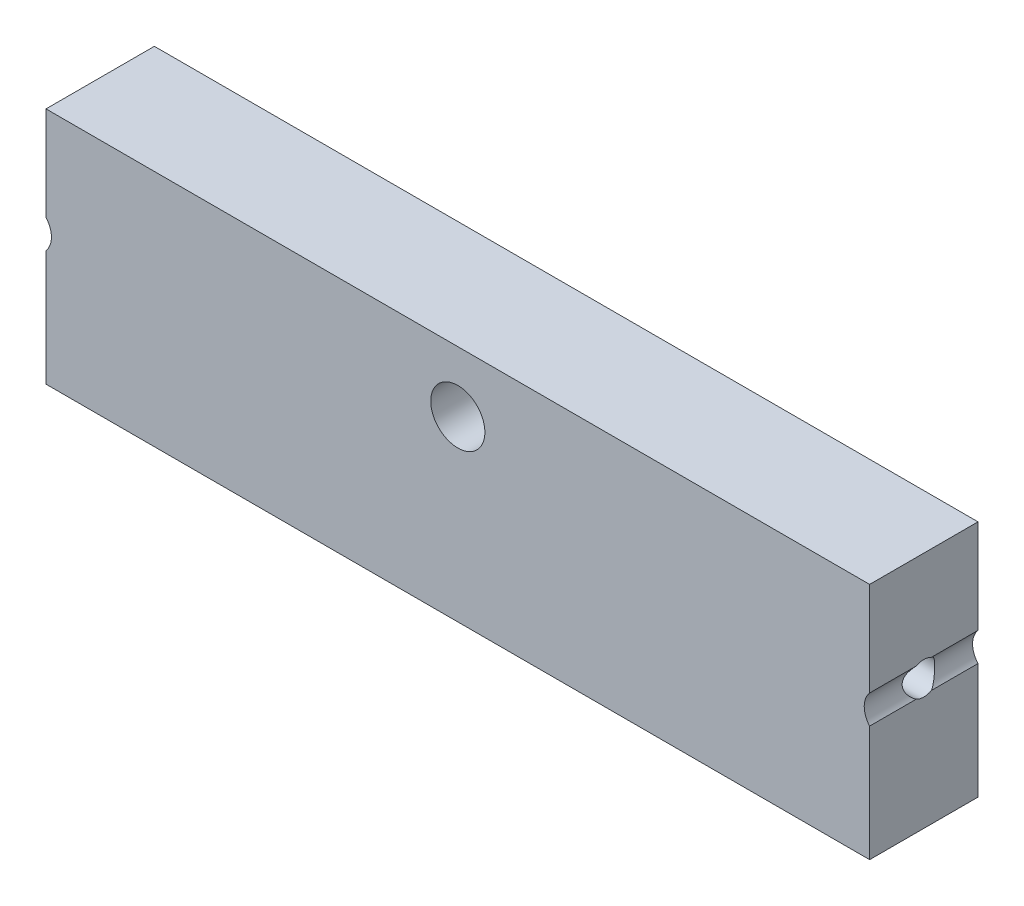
ISO-10303-21;
HEADER;
FILE_DESCRIPTION(('STEP AP214'),'2;1');
FILE_NAME('part.step','',(''),(''),'','','');
FILE_SCHEMA(('AUTOMOTIVE_DESIGN { 1 0 10303 214 1 1 1 1 }'));
ENDSEC;
DATA;
#1=APPLICATION_CONTEXT('core data for automotive mechanical design processes');
#2=APPLICATION_PROTOCOL_DEFINITION('international standard','automotive_design',2000,#1);
#3=PRODUCT_CONTEXT('',#1,'mechanical');
#4=PRODUCT('Part','Part','',(#3));
#5=PRODUCT_RELATED_PRODUCT_CATEGORY('part','',(#4));
#6=PRODUCT_DEFINITION_FORMATION('','',#4);
#7=PRODUCT_DEFINITION_CONTEXT('part definition',#1,'design');
#8=PRODUCT_DEFINITION('design','',#6,#7);
#9=PRODUCT_DEFINITION_SHAPE('','',#8);
#10=(LENGTH_UNIT() NAMED_UNIT(*) SI_UNIT(.MILLI.,.METRE.));
#11=(NAMED_UNIT(*) PLANE_ANGLE_UNIT() SI_UNIT($,.RADIAN.));
#12=(NAMED_UNIT(*) SI_UNIT($,.STERADIAN.) SOLID_ANGLE_UNIT());
#13=UNCERTAINTY_MEASURE_WITH_UNIT(LENGTH_MEASURE(1.E-05),#10,'distance_accuracy_value','');
#14=(GEOMETRIC_REPRESENTATION_CONTEXT(3) GLOBAL_UNCERTAINTY_ASSIGNED_CONTEXT((#13)) GLOBAL_UNIT_ASSIGNED_CONTEXT((#10,
#11,#12)) REPRESENTATION_CONTEXT('',''));
#15=CARTESIAN_POINT('',(0.,0.,0.));
#16=DIRECTION('',(0.,0.,1.));
#17=DIRECTION('',(1.,0.,0.));
#18=AXIS2_PLACEMENT_3D('',#15,#16,#17);
#19=CARTESIAN_POINT('',(-16.3699453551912,5.17661202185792,10.));
#20=DIRECTION('',(-1.,0.,0.));
#21=DIRECTION('',(0.,0.,1.));
#22=AXIS2_PLACEMENT_3D('',#19,#20,#21);
#23=PLANE('',#22);
#24=DIRECTION('',(0.,1.,0.));
#25=VECTOR('',#24,1.);
#26=CARTESIAN_POINT('',(-16.3699453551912,5.17661202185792,10.));
#27=LINE('',#26,#25);
#28=CARTESIAN_POINT('',(-16.3699453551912,18.4994876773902,10.));
#29=VERTEX_POINT('',#28);
#30=CARTESIAN_POINT('',(-16.3699453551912,27.1766120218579,10.));
#31=VERTEX_POINT('',#30);
#32=EDGE_CURVE('E136',#29,#31,#27,.T.);
#33=ORIENTED_EDGE('',*,*,#32,.F.);
#34=DIRECTION('',(0.,0.,-1.));
#35=VECTOR('',#34,1.);
#36=CARTESIAN_POINT('',(-16.3699453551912,18.4994876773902,10.));
#37=LINE('',#36,#35);
#38=CARTESIAN_POINT('',(-16.3699453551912,18.4994876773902,5.70710678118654));
#39=VERTEX_POINT('',#38);
#40=EDGE_CURVE('E123',#29,#39,#37,.T.);
#41=ORIENTED_EDGE('',*,*,#40,.T.);
#42=CARTESIAN_POINT('',(-16.3699453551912,17.1766120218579,5.));
#43=DIRECTION('',(1.,0.,0.));
#44=DIRECTION('',(0.,0.,-1.));
#45=AXIS2_PLACEMENT_3D('',#42,#43,#44);
#46=CIRCLE('',#45,1.5);
#47=CARTESIAN_POINT('',(-16.3699453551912,18.4994876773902,4.29289321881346));
#48=VERTEX_POINT('',#47);
#49=EDGE_CURVE('E224',#48,#39,#46,.T.);
#50=ORIENTED_EDGE('',*,*,#49,.F.);
#51=CARTESIAN_POINT('',(-16.3699453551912,18.4994876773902,0.));
#52=VERTEX_POINT('',#51);
#53=EDGE_CURVE('E60',#48,#52,#37,.T.);
#54=ORIENTED_EDGE('',*,*,#53,.T.);
#55=DIRECTION('',(0.,1.,0.));
#56=VECTOR('',#55,1.);
#57=CARTESIAN_POINT('',(-16.3699453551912,5.17661202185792,0.));
#58=LINE('',#57,#56);
#59=CARTESIAN_POINT('',(-16.3699453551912,27.1766120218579,0.));
#60=VERTEX_POINT('',#59);
#61=EDGE_CURVE('E242',#52,#60,#58,.T.);
#62=ORIENTED_EDGE('',*,*,#61,.T.);
#63=DIRECTION('',(0.,0.,-1.));
#64=VECTOR('',#63,1.);
#65=CARTESIAN_POINT('',(-16.3699453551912,27.1766120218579,10.));
#66=LINE('',#65,#64);
#67=EDGE_CURVE('E143',#31,#60,#66,.T.);
#68=ORIENTED_EDGE('',*,*,#67,.F.);
#69=EDGE_LOOP('',(#33,#41,#50,#54,#62,#68));
#70=FACE_BOUND('',#69,.T.);
#71=ADVANCED_FACE('F32',(#70),#23,.F.);
#72=CARTESIAN_POINT('',(-92.3699453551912,5.17661202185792,10.));
#73=DIRECTION('',(1.,0.,0.));
#74=DIRECTION('',(0.,0.,-1.));
#75=AXIS2_PLACEMENT_3D('',#72,#73,#74);
#76=PLANE('',#75);
#77=DIRECTION('',(0.,-1.,0.));
#78=VECTOR('',#77,1.);
#79=CARTESIAN_POINT('',(-92.3699453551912,5.17661202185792,10.));
#80=LINE('',#79,#78);
#81=CARTESIAN_POINT('',(-92.3699453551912,15.8537363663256,10.));
#82=VERTEX_POINT('',#81);
#83=CARTESIAN_POINT('',(-92.3699453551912,5.17661202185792,10.));
#84=VERTEX_POINT('',#83);
#85=EDGE_CURVE('E247',#82,#84,#80,.T.);
#86=ORIENTED_EDGE('',*,*,#85,.F.);
#87=DIRECTION('',(0.,0.,-1.));
#88=VECTOR('',#87,1.);
#89=CARTESIAN_POINT('',(-92.3699453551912,15.8537363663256,10.));
#90=LINE('',#89,#88);
#91=CARTESIAN_POINT('',(-92.3699453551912,15.8537363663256,5.70710678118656));
#92=VERTEX_POINT('',#91);
#93=EDGE_CURVE('E219',#82,#92,#90,.T.);
#94=ORIENTED_EDGE('',*,*,#93,.T.);
#95=CARTESIAN_POINT('',(-92.3699453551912,17.1766120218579,5.));
#96=DIRECTION('',(-1.,0.,0.));
#97=DIRECTION('',(0.,0.,1.));
#98=AXIS2_PLACEMENT_3D('',#95,#96,#97);
#99=CIRCLE('',#98,1.5);
#100=CARTESIAN_POINT('',(-92.3699453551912,15.8537363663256,4.29289321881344));
#101=VERTEX_POINT('',#100);
#102=EDGE_CURVE('E208',#101,#92,#99,.T.);
#103=ORIENTED_EDGE('',*,*,#102,.F.);
#104=CARTESIAN_POINT('',(-92.3699453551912,15.8537363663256,0.));
#105=VERTEX_POINT('',#104);
#106=EDGE_CURVE('E217',#101,#105,#90,.T.);
#107=ORIENTED_EDGE('',*,*,#106,.T.);
#108=DIRECTION('',(0.,-1.,0.));
#109=VECTOR('',#108,1.);
#110=CARTESIAN_POINT('',(-92.3699453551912,5.17661202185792,0.));
#111=LINE('',#110,#109);
#112=CARTESIAN_POINT('',(-92.3699453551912,5.17661202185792,0.));
#113=VERTEX_POINT('',#112);
#114=EDGE_CURVE('E236',#105,#113,#111,.T.);
#115=ORIENTED_EDGE('',*,*,#114,.T.);
#116=DIRECTION('',(0.,0.,-1.));
#117=VECTOR('',#116,1.);
#118=CARTESIAN_POINT('',(-92.3699453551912,5.17661202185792,10.));
#119=LINE('',#118,#117);
#120=EDGE_CURVE('E160',#84,#113,#119,.T.);
#121=ORIENTED_EDGE('',*,*,#120,.F.);
#122=EDGE_LOOP('',(#86,#94,#103,#107,#115,#121));
#123=FACE_BOUND('',#122,.T.);
#124=ADVANCED_FACE('F216',(#123),#76,.F.);
#125=CARTESIAN_POINT('',(-92.3699453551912,27.1766120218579,0.));
#126=VERTEX_POINT('',#125);
#127=CARTESIAN_POINT('',(-92.3699453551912,18.4994876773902,0.));
#128=VERTEX_POINT('',#127);
#129=EDGE_CURVE('E237',#126,#128,#111,.T.);
#130=ORIENTED_EDGE('',*,*,#129,.T.);
#131=DIRECTION('',(0.,0.,-1.));
#132=VECTOR('',#131,1.);
#133=CARTESIAN_POINT('',(-92.3699453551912,18.4994876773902,10.));
#134=LINE('',#133,#132);
#135=CARTESIAN_POINT('',(-92.3699453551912,18.4994876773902,4.29289321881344));
#136=VERTEX_POINT('',#135);
#137=EDGE_CURVE('E277',#128,#136,#134,.F.);
#138=ORIENTED_EDGE('',*,*,#137,.T.);
#139=CARTESIAN_POINT('',(-92.3699453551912,18.4994876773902,5.70710678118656));
#140=VERTEX_POINT('',#139);
#141=EDGE_CURVE('E210',#140,#136,#99,.T.);
#142=ORIENTED_EDGE('',*,*,#141,.F.);
#143=CARTESIAN_POINT('',(-92.3699453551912,18.4994876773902,10.));
#144=VERTEX_POINT('',#143);
#145=EDGE_CURVE('E274',#140,#144,#134,.F.);
#146=ORIENTED_EDGE('',*,*,#145,.T.);
#147=CARTESIAN_POINT('',(-92.3699453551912,27.1766120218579,10.));
#148=VERTEX_POINT('',#147);
#149=EDGE_CURVE('E148',#148,#144,#80,.T.);
#150=ORIENTED_EDGE('',*,*,#149,.F.);
#151=DIRECTION('',(0.,0.,-1.));
#152=VECTOR('',#151,1.);
#153=CARTESIAN_POINT('',(-92.3699453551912,27.1766120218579,10.));
#154=LINE('',#153,#152);
#155=EDGE_CURVE('E153',#148,#126,#154,.T.);
#156=ORIENTED_EDGE('',*,*,#155,.T.);
#157=EDGE_LOOP('',(#130,#138,#142,#146,#150,#156));
#158=FACE_BOUND('',#157,.T.);
#159=ADVANCED_FACE('F34',(#158),#76,.F.);
#160=CARTESIAN_POINT('',(-92.3699453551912,5.17661202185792,10.));
#161=DIRECTION('',(0.,1.,0.));
#162=DIRECTION('',(0.,0.,1.));
#163=AXIS2_PLACEMENT_3D('',#160,#161,#162);
#164=PLANE('',#163);
#165=DIRECTION('',(1.,0.,0.));
#166=VECTOR('',#165,1.);
#167=CARTESIAN_POINT('',(-92.3699453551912,5.17661202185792,0.));
#168=LINE('',#167,#166);
#169=CARTESIAN_POINT('',(-16.3699453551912,5.17661202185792,0.));
#170=VERTEX_POINT('',#169);
#171=EDGE_CURVE('E240',#113,#170,#168,.T.);
#172=ORIENTED_EDGE('',*,*,#171,.T.);
#173=DIRECTION('',(0.,0.,-1.));
#174=VECTOR('',#173,1.);
#175=CARTESIAN_POINT('',(-16.3699453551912,5.17661202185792,10.));
#176=LINE('',#175,#174);
#177=CARTESIAN_POINT('',(-16.3699453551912,5.17661202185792,10.));
#178=VERTEX_POINT('',#177);
#179=EDGE_CURVE('E157',#178,#170,#176,.T.);
#180=ORIENTED_EDGE('',*,*,#179,.F.);
#181=DIRECTION('',(1.,0.,0.));
#182=VECTOR('',#181,1.);
#183=CARTESIAN_POINT('',(-92.3699453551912,5.17661202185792,10.));
#184=LINE('',#183,#182);
#185=EDGE_CURVE('E145',#84,#178,#184,.T.);
#186=ORIENTED_EDGE('',*,*,#185,.F.);
#187=ORIENTED_EDGE('',*,*,#120,.T.);
#188=EDGE_LOOP('',(#172,#180,#186,#187));
#189=FACE_BOUND('',#188,.T.);
#190=ADVANCED_FACE('F256',(#189),#164,.F.);
#191=CARTESIAN_POINT('',(-16.3699453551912,15.8537363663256,0.));
#192=VERTEX_POINT('',#191);
#193=EDGE_CURVE('E243',#170,#192,#58,.T.);
#194=ORIENTED_EDGE('',*,*,#193,.T.);
#195=DIRECTION('',(0.,0.,-1.));
#196=VECTOR('',#195,1.);
#197=CARTESIAN_POINT('',(-16.3699453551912,15.8537363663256,10.));
#198=LINE('',#197,#196);
#199=CARTESIAN_POINT('',(-16.3699453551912,15.8537363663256,4.29289321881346));
#200=VERTEX_POINT('',#199);
#201=EDGE_CURVE('E131',#192,#200,#198,.F.);
#202=ORIENTED_EDGE('',*,*,#201,.T.);
#203=CARTESIAN_POINT('',(-16.3699453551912,15.8537363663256,5.70710678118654));
#204=VERTEX_POINT('',#203);
#205=EDGE_CURVE('E267',#204,#200,#46,.T.);
#206=ORIENTED_EDGE('',*,*,#205,.F.);
#207=CARTESIAN_POINT('',(-16.3699453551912,15.8537363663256,10.));
#208=VERTEX_POINT('',#207);
#209=EDGE_CURVE('E52',#204,#208,#198,.F.);
#210=ORIENTED_EDGE('',*,*,#209,.T.);
#211=EDGE_CURVE('E139',#178,#208,#27,.T.);
#212=ORIENTED_EDGE('',*,*,#211,.F.);
#213=ORIENTED_EDGE('',*,*,#179,.T.);
#214=EDGE_LOOP('',(#194,#202,#206,#210,#212,#213));
#215=FACE_BOUND('',#214,.T.);
#216=ADVANCED_FACE('F265',(#215),#23,.F.);
#217=CARTESIAN_POINT('',(-92.3699453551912,27.1766120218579,10.));
#218=DIRECTION('',(0.,-1.,0.));
#219=DIRECTION('',(0.,0.,-1.));
#220=AXIS2_PLACEMENT_3D('',#217,#218,#219);
#221=PLANE('',#220);
#222=DIRECTION('',(-1.,0.,0.));
#223=VECTOR('',#222,1.);
#224=CARTESIAN_POINT('',(-92.3699453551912,27.1766120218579,0.));
#225=LINE('',#224,#223);
#226=EDGE_CURVE('E246',#60,#126,#225,.T.);
#227=ORIENTED_EDGE('',*,*,#226,.T.);
#228=ORIENTED_EDGE('',*,*,#155,.F.);
#229=DIRECTION('',(-1.,0.,0.));
#230=VECTOR('',#229,1.);
#231=CARTESIAN_POINT('',(-92.3699453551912,27.1766120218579,10.));
#232=LINE('',#231,#230);
#233=EDGE_CURVE('E147',#31,#148,#232,.T.);
#234=ORIENTED_EDGE('',*,*,#233,.F.);
#235=ORIENTED_EDGE('',*,*,#67,.T.);
#236=EDGE_LOOP('',(#227,#228,#234,#235));
#237=FACE_BOUND('',#236,.T.);
#238=ADVANCED_FACE('F283',(#237),#221,.F.);
#239=CARTESIAN_POINT('',(-92.3699453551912,27.1766120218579,10.));
#240=DIRECTION('',(0.,0.,-1.));
#241=DIRECTION('',(-1.,0.,0.));
#242=AXIS2_PLACEMENT_3D('',#239,#240,#241);
#243=PLANE('',#242);
#244=CARTESIAN_POINT('',(-54.3699453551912,21.5766120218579,10.));
#245=DIRECTION('',(0.,0.,1.));
#246=DIRECTION('',(1.,0.,0.));
#247=AXIS2_PLACEMENT_3D('',#244,#245,#246);
#248=CIRCLE('',#247,2.5);
#249=CARTESIAN_POINT('',(-51.8699453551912,21.5766120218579,10.));
#250=VERTEX_POINT('',#249);
#251=EDGE_CURVE('E230',#250,#250,#248,.T.);
#252=ORIENTED_EDGE('',*,*,#251,.F.);
#253=EDGE_LOOP('',(#252));
#254=FACE_BOUND('',#253,.T.);
#255=ORIENTED_EDGE('',*,*,#211,.T.);
#256=CARTESIAN_POINT('',(-14.8699453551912,17.1766120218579,10.));
#257=DIRECTION('',(0.,0.,-1.));
#258=DIRECTION('',(-1.,0.,0.));
#259=AXIS2_PLACEMENT_3D('',#256,#257,#258);
#260=CIRCLE('',#259,2.);
#261=EDGE_CURVE('E126',#208,#29,#260,.T.);
#262=ORIENTED_EDGE('',*,*,#261,.T.);
#263=ORIENTED_EDGE('',*,*,#32,.T.);
#264=ORIENTED_EDGE('',*,*,#233,.T.);
#265=ORIENTED_EDGE('',*,*,#149,.T.);
#266=CARTESIAN_POINT('',(-93.8699453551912,17.1766120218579,10.));
#267=DIRECTION('',(0.,0.,-1.));
#268=DIRECTION('',(-1.,0.,0.));
#269=AXIS2_PLACEMENT_3D('',#266,#267,#268);
#270=CIRCLE('',#269,2.);
#271=EDGE_CURVE('E253',#144,#82,#270,.T.);
#272=ORIENTED_EDGE('',*,*,#271,.T.);
#273=ORIENTED_EDGE('',*,*,#85,.T.);
#274=ORIENTED_EDGE('',*,*,#185,.T.);
#275=EDGE_LOOP('',(#255,#262,#263,#264,#265,#272,#273,#274));
#276=FACE_BOUND('',#275,.T.);
#277=ADVANCED_FACE('F135',(#254,#276),#243,.F.);
#278=CARTESIAN_POINT('',(-92.3699453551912,27.1766120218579,0.));
#279=DIRECTION('',(0.,0.,-1.));
#280=DIRECTION('',(-1.,0.,0.));
#281=AXIS2_PLACEMENT_3D('',#278,#279,#280);
#282=PLANE('',#281);
#283=CARTESIAN_POINT('',(-14.8699453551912,17.1766120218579,0.));
#284=DIRECTION('',(0.,0.,-1.));
#285=DIRECTION('',(-1.,0.,0.));
#286=AXIS2_PLACEMENT_3D('',#283,#284,#285);
#287=CIRCLE('',#286,2.);
#288=EDGE_CURVE('E140',#192,#52,#287,.T.);
#289=ORIENTED_EDGE('',*,*,#288,.F.);
#290=ORIENTED_EDGE('',*,*,#193,.F.);
#291=ORIENTED_EDGE('',*,*,#171,.F.);
#292=ORIENTED_EDGE('',*,*,#114,.F.);
#293=CARTESIAN_POINT('',(-93.8699453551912,17.1766120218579,0.));
#294=DIRECTION('',(0.,0.,-1.));
#295=DIRECTION('',(-1.,0.,0.));
#296=AXIS2_PLACEMENT_3D('',#293,#294,#295);
#297=CIRCLE('',#296,2.);
#298=EDGE_CURVE('E269',#128,#105,#297,.T.);
#299=ORIENTED_EDGE('',*,*,#298,.F.);
#300=ORIENTED_EDGE('',*,*,#129,.F.);
#301=ORIENTED_EDGE('',*,*,#226,.F.);
#302=ORIENTED_EDGE('',*,*,#61,.F.);
#303=EDGE_LOOP('',(#289,#290,#291,#292,#299,#300,#301,#302));
#304=FACE_BOUND('',#303,.T.);
#305=CARTESIAN_POINT('',(-54.3699453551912,21.5766120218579,0.));
#306=DIRECTION('',(0.,0.,1.));
#307=DIRECTION('',(1.,0.,0.));
#308=AXIS2_PLACEMENT_3D('',#305,#306,#307);
#309=CIRCLE('',#308,2.5);
#310=CARTESIAN_POINT('',(-51.8699453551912,21.5766120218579,0.));
#311=VERTEX_POINT('',#310);
#312=EDGE_CURVE('E233',#311,#311,#309,.T.);
#313=ORIENTED_EDGE('',*,*,#312,.T.);
#314=EDGE_LOOP('',(#313));
#315=FACE_BOUND('',#314,.T.);
#316=ADVANCED_FACE('F262',(#304,#315),#282,.T.);
#317=CARTESIAN_POINT('',(-54.3699453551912,21.5766120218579,0.));
#318=DIRECTION('',(0.,0.,1.));
#319=DIRECTION('',(1.,0.,0.));
#320=AXIS2_PLACEMENT_3D('',#317,#318,#319);
#321=CYLINDRICAL_SURFACE('',#320,2.5);
#322=ORIENTED_EDGE('',*,*,#312,.F.);
#323=EDGE_LOOP('',(#322));
#324=FACE_BOUND('',#323,.T.);
#325=ORIENTED_EDGE('',*,*,#251,.T.);
#326=EDGE_LOOP('',(#325));
#327=FACE_BOUND('',#326,.T.);
#328=ADVANCED_FACE('F335',(#324,#327),#321,.F.);
#329=CARTESIAN_POINT('',(-82.3699453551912,17.1766120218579,5.));
#330=DIRECTION('',(-1.,0.,0.));
#331=DIRECTION('',(0.,0.,1.));
#332=AXIS2_PLACEMENT_3D('',#329,#330,#331);
#333=CYLINDRICAL_SURFACE('',#332,1.5);
#334=CARTESIAN_POINT('',(-82.3699453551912,17.1766120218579,5.));
#335=DIRECTION('',(-1.,0.,0.));
#336=DIRECTION('',(0.,0.,1.));
#337=AXIS2_PLACEMENT_3D('',#334,#335,#336);
#338=CIRCLE('',#337,1.5);
#339=CARTESIAN_POINT('',(-82.3699453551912,17.1766120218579,6.5));
#340=VERTEX_POINT('',#339);
#341=EDGE_CURVE('E222',#340,#340,#338,.T.);
#342=ORIENTED_EDGE('',*,*,#341,.F.);
#343=EDGE_LOOP('',(#342));
#344=FACE_BOUND('',#343,.T.);
#345=ORIENTED_EDGE('',*,*,#141,.T.);
#346=CARTESIAN_POINT('',(-92.3699453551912,18.4994876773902,4.29289321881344));
#347=CARTESIAN_POINT('',(-92.351077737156,18.4781039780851,4.2529131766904));
#348=CARTESIAN_POINT('',(-92.3315774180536,18.4550613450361,4.21414072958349));
#349=CARTESIAN_POINT('',(-92.2919107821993,18.4057582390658,4.13905490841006));
#350=CARTESIAN_POINT('',(-92.2717444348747,18.3794976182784,4.1027416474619));
#351=CARTESIAN_POINT('',(-92.2311425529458,18.3235789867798,4.03226691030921));
#352=CARTESIAN_POINT('',(-92.2107063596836,18.2938892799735,3.99813093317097));
#353=CARTESIAN_POINT('',(-92.1703010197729,18.2314081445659,3.93254617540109));
#354=CARTESIAN_POINT('',(-92.1503318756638,18.1986166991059,3.90109740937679));
#355=CARTESIAN_POINT('',(-92.0917799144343,18.0955094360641,3.81089161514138));
#356=CARTESIAN_POINT('',(-92.0546094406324,18.0205355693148,3.75636999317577));
#357=CARTESIAN_POINT('',(-91.9881471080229,17.8595150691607,3.6612278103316));
#358=CARTESIAN_POINT('',(-91.9588170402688,17.7735252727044,3.62053956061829));
#359=CARTESIAN_POINT('',(-91.9183318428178,17.6189046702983,3.56506524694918));
#360=CARTESIAN_POINT('',(-91.9043727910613,17.5524672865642,3.54618973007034));
#361=CARTESIAN_POINT('',(-91.883204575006,17.4165645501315,3.51769365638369));
#362=CARTESIAN_POINT('',(-91.8759934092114,17.3471001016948,3.50807035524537));
#363=CARTESIAN_POINT('',(-91.868942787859,17.2069683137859,3.49866026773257));
#364=CARTESIAN_POINT('',(-91.8691201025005,17.1362986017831,3.4988958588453));
#365=CARTESIAN_POINT('',(-91.8768706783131,16.9961011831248,3.50924240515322));
#366=CARTESIAN_POINT('',(-91.8844449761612,16.926573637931,3.51935474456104));
#367=CARTESIAN_POINT('',(-91.9059737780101,16.7928713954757,3.54835452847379));
#368=CARTESIAN_POINT('',(-91.9197126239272,16.7285961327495,3.56694568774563));
#369=CARTESIAN_POINT('',(-91.9525013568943,16.6042962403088,3.61189793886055));
#370=CARTESIAN_POINT('',(-91.9715519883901,16.5442722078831,3.63826011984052));
#371=CARTESIAN_POINT('',(-92.0161156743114,16.4229982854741,3.70106637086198));
#372=CARTESIAN_POINT('',(-92.042108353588,16.3623360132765,3.73829909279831));
#373=CARTESIAN_POINT('',(-92.0975441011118,16.2478204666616,3.8200384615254));
#374=CARTESIAN_POINT('',(-92.1269920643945,16.1939770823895,3.86455546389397));
#375=CARTESIAN_POINT('',(-92.1924670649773,16.085426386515,3.96763681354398));
#376=CARTESIAN_POINT('',(-92.2287953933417,16.0319447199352,4.02730924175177));
#377=CARTESIAN_POINT('',(-92.282770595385,15.9593252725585,4.12261562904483));
#378=CARTESIAN_POINT('',(-92.3006552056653,15.9364086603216,4.15530851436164));
#379=CARTESIAN_POINT('',(-92.3358425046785,15.893137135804,4.2226408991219));
#380=CARTESIAN_POINT('',(-92.3531452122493,15.8727821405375,4.2572803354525));
#381=CARTESIAN_POINT('',(-92.3699453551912,15.8537363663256,4.29289321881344));
#382=B_SPLINE_CURVE_WITH_KNOTS('',3,(#346,#347,#348,#349,#350,#351,#352,#353,#354,#355,#356,
#357,#358,#359,#360,#361,#362,#363,#364,#365,#366,#367,#368,#369,#370,#371,#372,#373,#374,#375,
#376,#377,#378,#379,#380,#381),.UNSPECIFIED.,.F.,.F.,(4,2,2,2,2,2,2,2,2,2,2,2,2,2,2,2,2,4),(0.,
0.147252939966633,0.294512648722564,0.4432628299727,0.592013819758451,0.889911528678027,
1.18632986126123,1.39682529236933,1.60725826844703,1.81816890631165,2.02910910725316,
2.23318451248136,2.43728853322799,2.66377865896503,2.89059361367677,3.15349717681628,
3.28463821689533,3.41577500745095),.UNSPECIFIED.);
#383=EDGE_CURVE('E171',#136,#101,#382,.T.);
#384=ORIENTED_EDGE('',*,*,#383,.T.);
#385=ORIENTED_EDGE('',*,*,#102,.T.);
#386=CARTESIAN_POINT('',(-92.3699453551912,15.8537363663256,5.70710678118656));
#387=CARTESIAN_POINT('',(-92.351077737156,15.8751200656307,5.7470868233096));
#388=CARTESIAN_POINT('',(-92.3315774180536,15.8981626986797,5.78585927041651));
#389=CARTESIAN_POINT('',(-92.2919107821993,15.94746580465,5.86094509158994));
#390=CARTESIAN_POINT('',(-92.2717444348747,15.9737264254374,5.8972583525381));
#391=CARTESIAN_POINT('',(-92.2311425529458,16.0296450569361,5.96773308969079));
#392=CARTESIAN_POINT('',(-92.2107063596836,16.0593347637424,6.00186906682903));
#393=CARTESIAN_POINT('',(-92.1703010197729,16.12181589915,6.06745382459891));
#394=CARTESIAN_POINT('',(-92.1503318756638,16.1546073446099,6.09890259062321));
#395=CARTESIAN_POINT('',(-92.0917799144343,16.2577146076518,6.18910838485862));
#396=CARTESIAN_POINT('',(-92.0546094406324,16.3326884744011,6.24363000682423));
#397=CARTESIAN_POINT('',(-91.9881471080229,16.4937089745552,6.3387721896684));
#398=CARTESIAN_POINT('',(-91.9588170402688,16.5796987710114,6.37946043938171));
#399=CARTESIAN_POINT('',(-91.9183318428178,16.7343193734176,6.43493475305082));
#400=CARTESIAN_POINT('',(-91.9043727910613,16.8007567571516,6.45381026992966));
#401=CARTESIAN_POINT('',(-91.883204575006,16.9366594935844,6.48230634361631));
#402=CARTESIAN_POINT('',(-91.8759934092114,17.006123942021,6.49192964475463));
#403=CARTESIAN_POINT('',(-91.868942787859,17.14625572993,6.50133973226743));
#404=CARTESIAN_POINT('',(-91.8691201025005,17.2169254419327,6.5011041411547));
#405=CARTESIAN_POINT('',(-91.8768706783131,17.3571228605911,6.49075759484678));
#406=CARTESIAN_POINT('',(-91.8844449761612,17.4266504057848,6.48064525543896));
#407=CARTESIAN_POINT('',(-91.9059737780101,17.5603526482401,6.45164547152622));
#408=CARTESIAN_POINT('',(-91.9197126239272,17.6246279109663,6.43305431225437));
#409=CARTESIAN_POINT('',(-91.9525013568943,17.748927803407,6.38810206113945));
#410=CARTESIAN_POINT('',(-91.9715519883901,17.8089518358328,6.36173988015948));
#411=CARTESIAN_POINT('',(-92.0161156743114,17.9302257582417,6.29893362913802));
#412=CARTESIAN_POINT('',(-92.042108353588,17.9908880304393,6.26170090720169));
#413=CARTESIAN_POINT('',(-92.0975441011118,18.1054035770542,6.1799615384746));
#414=CARTESIAN_POINT('',(-92.1269920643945,18.1592469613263,6.13544453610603));
#415=CARTESIAN_POINT('',(-92.1924670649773,18.2677976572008,6.03236318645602));
#416=CARTESIAN_POINT('',(-92.2287953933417,18.3212793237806,5.97269075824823));
#417=CARTESIAN_POINT('',(-92.282770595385,18.3938987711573,5.87738437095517));
#418=CARTESIAN_POINT('',(-92.3006552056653,18.4168153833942,5.84469148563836));
#419=CARTESIAN_POINT('',(-92.3358425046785,18.4600869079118,5.7773591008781));
#420=CARTESIAN_POINT('',(-92.3531452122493,18.4804419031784,5.7427196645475));
#421=CARTESIAN_POINT('',(-92.3699453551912,18.4994876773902,5.70710678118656));
#422=B_SPLINE_CURVE_WITH_KNOTS('',3,(#386,#387,#388,#389,#390,#391,#392,#393,#394,#395,#396,
#397,#398,#399,#400,#401,#402,#403,#404,#405,#406,#407,#408,#409,#410,#411,#412,#413,#414,#415,
#416,#417,#418,#419,#420,#421),.UNSPECIFIED.,.F.,.F.,(4,2,2,2,2,2,2,2,2,2,2,2,2,2,2,2,2,4),(0.,
0.147252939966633,0.294512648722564,0.4432628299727,0.592013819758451,0.889911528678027,
1.18632986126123,1.39682529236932,1.60725826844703,1.81816890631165,2.02910910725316,
2.23318451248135,2.43728853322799,2.66377865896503,2.89059361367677,3.15349717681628,
3.28463821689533,3.41577500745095),.UNSPECIFIED.);
#423=EDGE_CURVE('E163',#92,#140,#422,.T.);
#424=ORIENTED_EDGE('',*,*,#423,.T.);
#425=EDGE_LOOP('',(#345,#384,#385,#424));
#426=FACE_BOUND('',#425,.T.);
#427=ADVANCED_FACE('F175',(#344,#426),#333,.F.);
#428=CARTESIAN_POINT('',(-82.3699453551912,17.1766120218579,5.));
#429=DIRECTION('',(-1.,0.,0.));
#430=DIRECTION('',(0.,0.,1.));
#431=AXIS2_PLACEMENT_3D('',#428,#429,#430);
#432=PLANE('',#431);
#433=ORIENTED_EDGE('',*,*,#341,.T.);
#434=EDGE_LOOP('',(#433));
#435=FACE_BOUND('',#434,.T.);
#436=ADVANCED_FACE('F194',(#435),#432,.T.);
#437=CARTESIAN_POINT('',(-26.3699453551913,17.1766120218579,5.));
#438=DIRECTION('',(1.,0.,0.));
#439=DIRECTION('',(0.,0.,-1.));
#440=AXIS2_PLACEMENT_3D('',#437,#438,#439);
#441=CYLINDRICAL_SURFACE('',#440,1.5);
#442=CARTESIAN_POINT('',(-26.3699453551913,17.1766120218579,5.));
#443=DIRECTION('',(1.,0.,0.));
#444=DIRECTION('',(0.,0.,-1.));
#445=AXIS2_PLACEMENT_3D('',#442,#443,#444);
#446=CIRCLE('',#445,1.5);
#447=CARTESIAN_POINT('',(-26.3699453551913,17.1766120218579,3.5));
#448=VERTEX_POINT('',#447);
#449=EDGE_CURVE('E220',#448,#448,#446,.T.);
#450=ORIENTED_EDGE('',*,*,#449,.F.);
#451=EDGE_LOOP('',(#450));
#452=FACE_BOUND('',#451,.T.);
#453=ORIENTED_EDGE('',*,*,#205,.T.);
#454=CARTESIAN_POINT('',(-16.3699453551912,15.8537363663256,4.29289321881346));
#455=CARTESIAN_POINT('',(-16.3888129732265,15.8751200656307,4.25291317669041));
#456=CARTESIAN_POINT('',(-16.4083132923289,15.8981626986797,4.2141407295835));
#457=CARTESIAN_POINT('',(-16.4479799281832,15.94746580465,4.13905490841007));
#458=CARTESIAN_POINT('',(-16.4681462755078,15.9737264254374,4.10274164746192));
#459=CARTESIAN_POINT('',(-16.5087481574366,16.029645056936,4.03226691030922));
#460=CARTESIAN_POINT('',(-16.5291843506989,16.0593347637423,3.99813093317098));
#461=CARTESIAN_POINT('',(-16.5695896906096,16.12181589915,3.93254617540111));
#462=CARTESIAN_POINT('',(-16.5895588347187,16.1546073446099,3.9010974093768));
#463=CARTESIAN_POINT('',(-16.6481107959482,16.2577146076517,3.81089161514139));
#464=CARTESIAN_POINT('',(-16.6852812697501,16.3326884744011,3.75636999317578));
#465=CARTESIAN_POINT('',(-16.7517436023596,16.4937089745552,3.66122781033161));
#466=CARTESIAN_POINT('',(-16.7810736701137,16.5796987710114,3.6205395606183));
#467=CARTESIAN_POINT('',(-16.8215588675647,16.7343193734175,3.56506524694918));
#468=CARTESIAN_POINT('',(-16.8355179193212,16.8007567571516,3.54618973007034));
#469=CARTESIAN_POINT('',(-16.8566861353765,16.9366594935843,3.51769365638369));
#470=CARTESIAN_POINT('',(-16.8638973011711,17.006123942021,3.50807035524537));
#471=CARTESIAN_POINT('',(-16.8709479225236,17.1462557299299,3.49866026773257));
#472=CARTESIAN_POINT('',(-16.870770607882,17.2169254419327,3.4988958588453));
#473=CARTESIAN_POINT('',(-16.8630200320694,17.3571228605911,3.50924240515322));
#474=CARTESIAN_POINT('',(-16.8554457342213,17.4266504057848,3.51935474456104));
#475=CARTESIAN_POINT('',(-16.8339169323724,17.5603526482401,3.54835452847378));
#476=CARTESIAN_POINT('',(-16.8201780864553,17.6246279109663,3.56694568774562));
#477=CARTESIAN_POINT('',(-16.7873893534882,17.748927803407,3.61189793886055));
#478=CARTESIAN_POINT('',(-16.7683387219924,17.8089518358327,3.63826011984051));
#479=CARTESIAN_POINT('',(-16.7237750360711,17.9302257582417,3.70106637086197));
#480=CARTESIAN_POINT('',(-16.6977823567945,17.9908880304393,3.7382990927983));
#481=CARTESIAN_POINT('',(-16.6423466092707,18.1054035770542,3.82003846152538));
#482=CARTESIAN_POINT('',(-16.612898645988,18.1592469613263,3.86455546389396));
#483=CARTESIAN_POINT('',(-16.5474236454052,18.2677976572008,3.96763681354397));
#484=CARTESIAN_POINT('',(-16.5110953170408,18.3212793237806,4.02730924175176));
#485=CARTESIAN_POINT('',(-16.4571201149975,18.3938987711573,4.12261562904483));
#486=CARTESIAN_POINT('',(-16.4392355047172,18.4168153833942,4.15530851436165));
#487=CARTESIAN_POINT('',(-16.404048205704,18.4600869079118,4.22264089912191));
#488=CARTESIAN_POINT('',(-16.3867454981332,18.4804419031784,4.25728033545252));
#489=CARTESIAN_POINT('',(-16.3699453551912,18.4994876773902,4.29289321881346));
#490=B_SPLINE_CURVE_WITH_KNOTS('',3,(#454,#455,#456,#457,#458,#459,#460,#461,#462,#463,#464,
#465,#466,#467,#468,#469,#470,#471,#472,#473,#474,#475,#476,#477,#478,#479,#480,#481,#482,#483,
#484,#485,#486,#487,#488,#489),.UNSPECIFIED.,.F.,.F.,(4,2,2,2,2,2,2,2,2,2,2,2,2,2,2,2,2,4),(0.,
0.147252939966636,0.294512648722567,0.443262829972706,0.59201381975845,0.889911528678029,
1.18632986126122,1.39682529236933,1.60725826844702,1.81816890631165,2.02910910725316,
2.23318451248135,2.437288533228,2.66377865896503,2.89059361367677,3.1534971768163,
3.28463821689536,3.41577500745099),.UNSPECIFIED.);
#491=EDGE_CURVE('E11',#200,#48,#490,.T.);
#492=ORIENTED_EDGE('',*,*,#491,.T.);
#493=ORIENTED_EDGE('',*,*,#49,.T.);
#494=CARTESIAN_POINT('',(-16.3699453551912,18.4994876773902,5.70710678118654));
#495=CARTESIAN_POINT('',(-16.3888129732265,18.4781039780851,5.74708682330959));
#496=CARTESIAN_POINT('',(-16.4083132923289,18.4550613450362,5.7858592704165));
#497=CARTESIAN_POINT('',(-16.4479799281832,18.4057582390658,5.86094509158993));
#498=CARTESIAN_POINT('',(-16.4681462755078,18.3794976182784,5.89725835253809));
#499=CARTESIAN_POINT('',(-16.5087481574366,18.3235789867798,5.96773308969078));
#500=CARTESIAN_POINT('',(-16.5291843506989,18.2938892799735,6.00186906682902));
#501=CARTESIAN_POINT('',(-16.5695896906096,18.2314081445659,6.06745382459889));
#502=CARTESIAN_POINT('',(-16.5895588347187,18.198616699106,6.0989025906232));
#503=CARTESIAN_POINT('',(-16.6481107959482,18.0955094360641,6.18910838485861));
#504=CARTESIAN_POINT('',(-16.6852812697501,18.0205355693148,6.24363000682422));
#505=CARTESIAN_POINT('',(-16.7517436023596,17.8595150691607,6.33877218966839));
#506=CARTESIAN_POINT('',(-16.7810736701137,17.7735252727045,6.3794604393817));
#507=CARTESIAN_POINT('',(-16.8215588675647,17.6189046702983,6.43493475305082));
#508=CARTESIAN_POINT('',(-16.8355179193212,17.5524672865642,6.45381026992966));
#509=CARTESIAN_POINT('',(-16.8566861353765,17.4165645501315,6.48230634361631));
#510=CARTESIAN_POINT('',(-16.8638973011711,17.3471001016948,6.49192964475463));
#511=CARTESIAN_POINT('',(-16.8709479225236,17.2069683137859,6.50133973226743));
#512=CARTESIAN_POINT('',(-16.870770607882,17.1362986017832,6.5011041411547));
#513=CARTESIAN_POINT('',(-16.8630200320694,16.9961011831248,6.49075759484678));
#514=CARTESIAN_POINT('',(-16.8554457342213,16.926573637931,6.48064525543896));
#515=CARTESIAN_POINT('',(-16.8339169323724,16.7928713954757,6.45164547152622));
#516=CARTESIAN_POINT('',(-16.8201780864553,16.7285961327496,6.43305431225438));
#517=CARTESIAN_POINT('',(-16.7873893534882,16.6042962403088,6.38810206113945));
#518=CARTESIAN_POINT('',(-16.7683387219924,16.5442722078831,6.36173988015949));
#519=CARTESIAN_POINT('',(-16.7237750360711,16.4229982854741,6.29893362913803));
#520=CARTESIAN_POINT('',(-16.6977823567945,16.3623360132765,6.2617009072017));
#521=CARTESIAN_POINT('',(-16.6423466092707,16.2478204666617,6.17996153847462));
#522=CARTESIAN_POINT('',(-16.612898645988,16.1939770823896,6.13544453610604));
#523=CARTESIAN_POINT('',(-16.5474236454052,16.0854263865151,6.03236318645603));
#524=CARTESIAN_POINT('',(-16.5110953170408,16.0319447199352,5.97269075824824));
#525=CARTESIAN_POINT('',(-16.4571201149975,15.9593252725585,5.87738437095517));
#526=CARTESIAN_POINT('',(-16.4392355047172,15.9364086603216,5.84469148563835));
#527=CARTESIAN_POINT('',(-16.404048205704,15.893137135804,5.77735910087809));
#528=CARTESIAN_POINT('',(-16.3867454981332,15.8727821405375,5.74271966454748));
#529=CARTESIAN_POINT('',(-16.3699453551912,15.8537363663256,5.70710678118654));
#530=B_SPLINE_CURVE_WITH_KNOTS('',3,(#494,#495,#496,#497,#498,#499,#500,#501,#502,#503,#504,
#505,#506,#507,#508,#509,#510,#511,#512,#513,#514,#515,#516,#517,#518,#519,#520,#521,#522,#523,
#524,#525,#526,#527,#528,#529),.UNSPECIFIED.,.F.,.F.,(4,2,2,2,2,2,2,2,2,2,2,2,2,2,2,2,2,4),(0.,
0.147252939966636,0.294512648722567,0.443262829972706,0.59201381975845,0.889911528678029,
1.18632986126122,1.39682529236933,1.60725826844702,1.81816890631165,2.02910910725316,
2.23318451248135,2.437288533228,2.66377865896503,2.89059361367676,3.1534971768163,
3.28463821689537,3.41577500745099),.UNSPECIFIED.);
#531=EDGE_CURVE('E45',#39,#204,#530,.T.);
#532=ORIENTED_EDGE('',*,*,#531,.T.);
#533=EDGE_LOOP('',(#453,#492,#493,#532));
#534=FACE_BOUND('',#533,.T.);
#535=ADVANCED_FACE('F190',(#452,#534),#441,.F.);
#536=CARTESIAN_POINT('',(-26.3699453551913,17.1766120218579,5.));
#537=DIRECTION('',(1.,0.,0.));
#538=DIRECTION('',(0.,0.,-1.));
#539=AXIS2_PLACEMENT_3D('',#536,#537,#538);
#540=PLANE('',#539);
#541=ORIENTED_EDGE('',*,*,#449,.T.);
#542=EDGE_LOOP('',(#541));
#543=FACE_BOUND('',#542,.T.);
#544=ADVANCED_FACE('F187',(#543),#540,.T.);
#545=CARTESIAN_POINT('',(-93.8699453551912,17.1766120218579,10.));
#546=DIRECTION('',(0.,0.,-1.));
#547=DIRECTION('',(-1.,0.,0.));
#548=AXIS2_PLACEMENT_3D('',#545,#546,#547);
#549=CYLINDRICAL_SURFACE('',#548,2.);
#550=ORIENTED_EDGE('',*,*,#271,.F.);
#551=ORIENTED_EDGE('',*,*,#145,.F.);
#552=ORIENTED_EDGE('',*,*,#423,.F.);
#553=ORIENTED_EDGE('',*,*,#93,.F.);
#554=EDGE_LOOP('',(#550,#551,#552,#553));
#555=FACE_BOUND('',#554,.T.);
#556=ADVANCED_FACE('F183',(#555),#549,.F.);
#557=ORIENTED_EDGE('',*,*,#383,.F.);
#558=ORIENTED_EDGE('',*,*,#137,.F.);
#559=ORIENTED_EDGE('',*,*,#298,.T.);
#560=ORIENTED_EDGE('',*,*,#106,.F.);
#561=EDGE_LOOP('',(#557,#558,#559,#560));
#562=FACE_BOUND('',#561,.T.);
#563=ADVANCED_FACE('F179',(#562),#549,.F.);
#564=CARTESIAN_POINT('',(-14.8699453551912,17.1766120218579,10.));
#565=DIRECTION('',(0.,0.,-1.));
#566=DIRECTION('',(-1.,0.,0.));
#567=AXIS2_PLACEMENT_3D('',#564,#565,#566);
#568=CYLINDRICAL_SURFACE('',#567,2.);
#569=ORIENTED_EDGE('',*,*,#261,.F.);
#570=ORIENTED_EDGE('',*,*,#209,.F.);
#571=ORIENTED_EDGE('',*,*,#531,.F.);
#572=ORIENTED_EDGE('',*,*,#40,.F.);
#573=EDGE_LOOP('',(#569,#570,#571,#572));
#574=FACE_BOUND('',#573,.T.);
#575=ADVANCED_FACE('F125',(#574),#568,.F.);
#576=ORIENTED_EDGE('',*,*,#491,.F.);
#577=ORIENTED_EDGE('',*,*,#201,.F.);
#578=ORIENTED_EDGE('',*,*,#288,.T.);
#579=ORIENTED_EDGE('',*,*,#53,.F.);
#580=EDGE_LOOP('',(#576,#577,#578,#579));
#581=FACE_BOUND('',#580,.T.);
#582=ADVANCED_FACE('F185',(#581),#568,.F.);
#583=CLOSED_SHELL('',(#71,#124,#159,#190,#216,#238,#277,#316,#328,#427,#436,#535,#544,#556,#563,
#575,#582));
#584=MANIFOLD_SOLID_BREP('B2',#583);
#585=ADVANCED_BREP_SHAPE_REPRESENTATION('',(#18,#584),#14);
#586=SHAPE_DEFINITION_REPRESENTATION(#9,#585);
ENDSEC;
END-ISO-10303-21;
